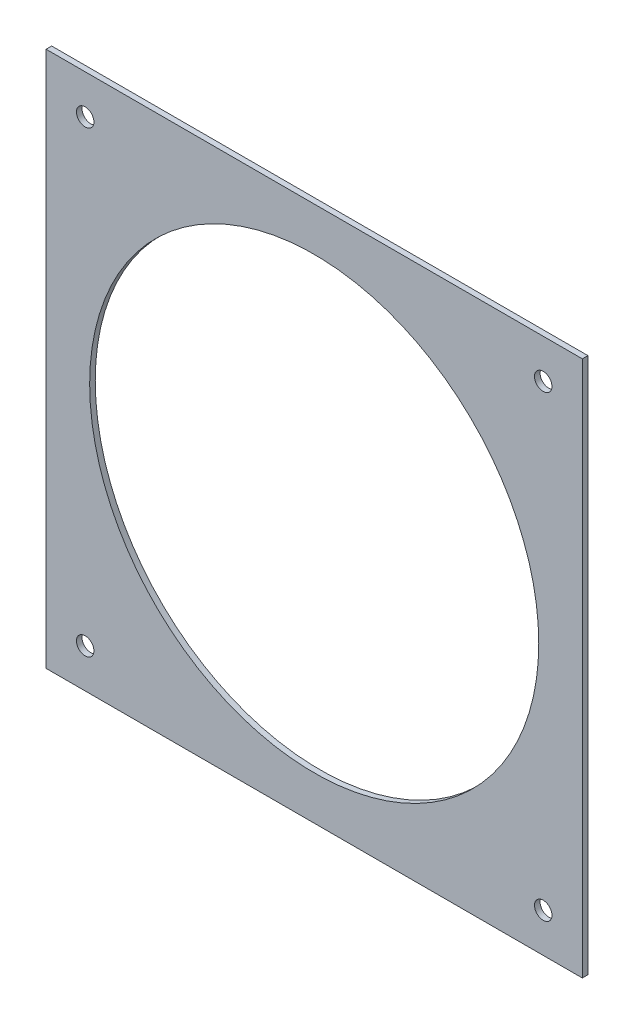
from build123d import *

# Parameters (mm, degrees)
SKETCH1_W                        = 304.8
SKETCH1_H                        = 304.8
SKETCH1_R                        = 127.635
BOSS_EXTRUDE1_DEPTH              = 3.175
F_25_64_0_39063_DIAMETER_HOLE1_D = 9.922002


with BuildPart() as part:
    # Sketch1 → Boss-Extrude1 (new body)
    with BuildSketch(Plane.XY):
        with Locations((152.4, 152.4)):
            Rectangle(SKETCH1_W, SKETCH1_H)
        with Locations((152.4, 152.4)):
            Circle(SKETCH1_R, mode=Mode.SUBTRACT)
    extrude(amount=BOSS_EXTRUDE1_DEPTH)

    # 25_64 _0.39063_ Diameter Hole1 (through all)
    with Locations(Plane.XY.offset(3.175)):
        with Locations((22.225, 22.225), (282.575, 22.225), (282.575, 282.575), (22.225, 282.575)):
            Hole(F_25_64_0_39063_DIAMETER_HOLE1_D / 2)


solid = part.part
